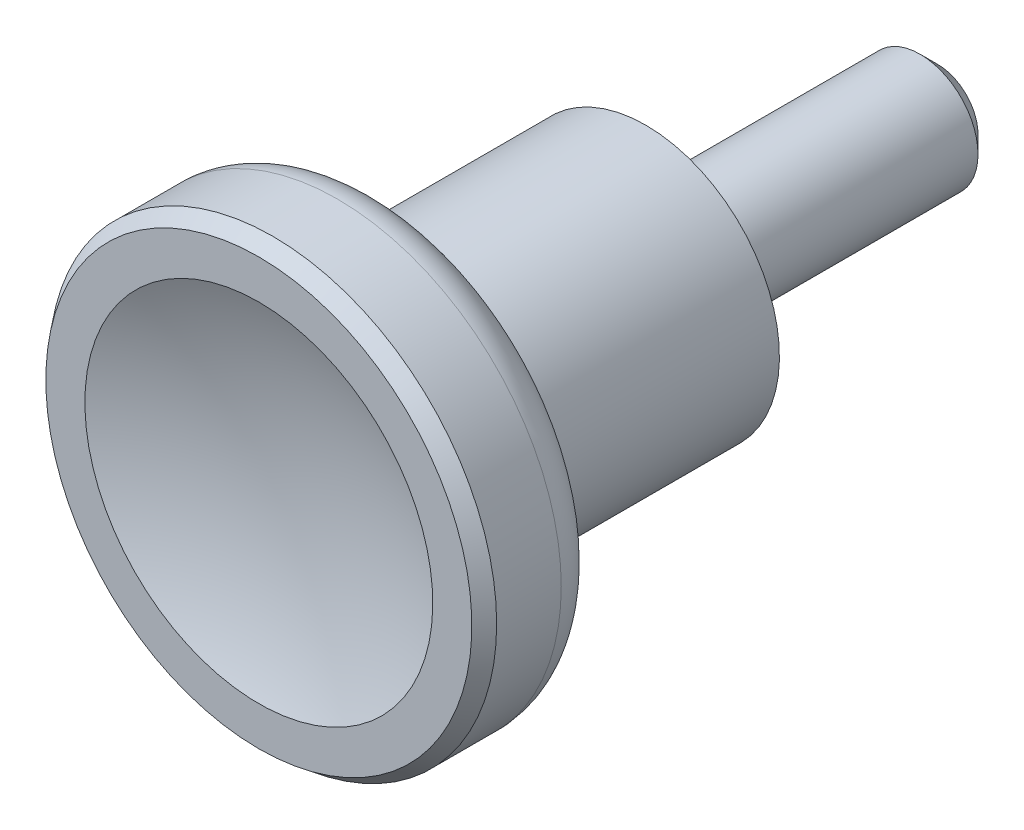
ISO-10303-21;
HEADER;
FILE_DESCRIPTION(('STEP AP214'),'2;1');
FILE_NAME('part.step','',(''),(''),'','','');
FILE_SCHEMA(('AUTOMOTIVE_DESIGN { 1 0 10303 214 1 1 1 1 }'));
ENDSEC;
DATA;
#1=APPLICATION_CONTEXT('core data for automotive mechanical design processes');
#2=APPLICATION_PROTOCOL_DEFINITION('international standard','automotive_design',2000,#1);
#3=PRODUCT_CONTEXT('',#1,'mechanical');
#4=PRODUCT('Part','Part','',(#3));
#5=PRODUCT_RELATED_PRODUCT_CATEGORY('part','',(#4));
#6=PRODUCT_DEFINITION_FORMATION('','',#4);
#7=PRODUCT_DEFINITION_CONTEXT('part definition',#1,'design');
#8=PRODUCT_DEFINITION('design','',#6,#7);
#9=PRODUCT_DEFINITION_SHAPE('','',#8);
#10=(LENGTH_UNIT() NAMED_UNIT(*) SI_UNIT(.MILLI.,.METRE.));
#11=(NAMED_UNIT(*) PLANE_ANGLE_UNIT() SI_UNIT($,.RADIAN.));
#12=(NAMED_UNIT(*) SI_UNIT($,.STERADIAN.) SOLID_ANGLE_UNIT());
#13=UNCERTAINTY_MEASURE_WITH_UNIT(LENGTH_MEASURE(1.E-05),#10,'distance_accuracy_value','');
#14=(GEOMETRIC_REPRESENTATION_CONTEXT(3) GLOBAL_UNCERTAINTY_ASSIGNED_CONTEXT((#13)) GLOBAL_UNIT_ASSIGNED_CONTEXT((#10,
#11,#12)) REPRESENTATION_CONTEXT('',''));
#15=CARTESIAN_POINT('',(0.,0.,0.));
#16=DIRECTION('',(0.,0.,1.));
#17=DIRECTION('',(1.,0.,0.));
#18=AXIS2_PLACEMENT_3D('',#15,#16,#17);
#19=CARTESIAN_POINT('',(9.25,0.,0.2));
#20=DIRECTION('',(0.,0.,1.));
#21=DIRECTION('',(0.,-1.,0.));
#22=AXIS2_PLACEMENT_3D('',#19,#20,#21);
#23=PLANE('',#22);
#24=CARTESIAN_POINT('',(0.,0.,0.2));
#25=DIRECTION('',(0.,0.,-1.));
#26=DIRECTION('',(0.,1.,0.));
#27=AXIS2_PLACEMENT_3D('',#24,#25,#26);
#28=CIRCLE('',#27,5.);
#29=CARTESIAN_POINT('',(0.,5.,0.2));
#30=VERTEX_POINT('',#29);
#31=EDGE_CURVE('E56',#30,#30,#28,.T.);
#32=ORIENTED_EDGE('',*,*,#31,.F.);
#33=EDGE_LOOP('',(#32));
#34=FACE_BOUND('',#33,.T.);
#35=CARTESIAN_POINT('',(0.,0.,0.2));
#36=DIRECTION('',(0.,0.,-1.));
#37=DIRECTION('',(0.,1.,0.));
#38=AXIS2_PLACEMENT_3D('',#35,#36,#37);
#39=CIRCLE('',#38,9.25);
#40=CARTESIAN_POINT('',(0.,9.25,0.2));
#41=VERTEX_POINT('',#40);
#42=EDGE_CURVE('E23',#41,#41,#39,.T.);
#43=ORIENTED_EDGE('',*,*,#42,.T.);
#44=EDGE_LOOP('',(#43));
#45=FACE_BOUND('',#44,.T.);
#46=ADVANCED_FACE('F12',(#34,#45),#23,.F.);
#47=CARTESIAN_POINT('',(0.,0.,-4.9324732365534));
#48=DIRECTION('',(0.,0.,-1.));
#49=DIRECTION('',(0.,1.,0.));
#50=AXIS2_PLACEMENT_3D('',#47,#48,#49);
#51=CYLINDRICAL_SURFACE('',#50,9.25);
#52=CARTESIAN_POINT('',(0.,0.,17.));
#53=DIRECTION('',(0.,0.,-1.));
#54=DIRECTION('',(0.,1.,0.));
#55=AXIS2_PLACEMENT_3D('',#52,#53,#54);
#56=CIRCLE('',#55,9.25);
#57=CARTESIAN_POINT('',(0.,9.25,17.));
#58=VERTEX_POINT('',#57);
#59=EDGE_CURVE('E27',#58,#58,#56,.T.);
#60=ORIENTED_EDGE('',*,*,#59,.T.);
#61=EDGE_LOOP('',(#60));
#62=FACE_BOUND('',#61,.T.);
#63=ORIENTED_EDGE('',*,*,#42,.F.);
#64=EDGE_LOOP('',(#63));
#65=FACE_BOUND('',#64,.T.);
#66=ADVANCED_FACE('F64',(#62,#65),#51,.T.);
#67=CARTESIAN_POINT('',(0.,0.,17.));
#68=DIRECTION('',(0.,0.,-1.));
#69=DIRECTION('',(0.,1.,0.));
#70=AXIS2_PLACEMENT_3D('',#67,#68,#69);
#71=TOROIDAL_SURFACE('',#70,10.0070026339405,0.757002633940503);
#72=ORIENTED_EDGE('',*,*,#59,.F.);
#73=EDGE_LOOP('',(#72));
#74=FACE_BOUND('',#73,.T.);
#75=CARTESIAN_POINT('',(0.,0.,17.7312080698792));
#76=DIRECTION('',(0.,0.,-1.));
#77=DIRECTION('',(0.,1.,0.));
#78=AXIS2_PLACEMENT_3D('',#75,#76,#77);
#79=CIRCLE('',#78,9.81107472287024);
#80=CARTESIAN_POINT('',(0.,9.81107472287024,17.7312080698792));
#81=VERTEX_POINT('',#80);
#82=EDGE_CURVE('E32',#81,#81,#79,.T.);
#83=ORIENTED_EDGE('',*,*,#82,.T.);
#84=EDGE_LOOP('',(#83));
#85=FACE_BOUND('',#84,.T.);
#86=ADVANCED_FACE('F68',(#74,#85),#71,.F.);
#87=CARTESIAN_POINT('',(0.,0.,17.7312080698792));
#88=DIRECTION('',(0.,0.,1.));
#89=DIRECTION('',(0.,-1.,0.));
#90=AXIS2_PLACEMENT_3D('',#87,#88,#89);
#91=CONICAL_SURFACE('',#90,9.81107472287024,1.30899528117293);
#92=CARTESIAN_POINT('',(0.,0.,18.6597619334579));
#93=DIRECTION('',(0.,0.,-1.));
#94=DIRECTION('',(0.,1.,0.));
#95=AXIS2_PLACEMENT_3D('',#92,#93,#94);
#96=CIRCLE('',#95,13.2764619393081);
#97=CARTESIAN_POINT('',(0.,13.2764619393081,18.6597619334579));
#98=VERTEX_POINT('',#97);
#99=EDGE_CURVE('E35',#98,#98,#96,.T.);
#100=ORIENTED_EDGE('',*,*,#99,.T.);
#101=EDGE_LOOP('',(#100));
#102=FACE_BOUND('',#101,.T.);
#103=ORIENTED_EDGE('',*,*,#82,.F.);
#104=EDGE_LOOP('',(#103));
#105=FACE_BOUND('',#104,.T.);
#106=ADVANCED_FACE('F76',(#102,#105),#91,.T.);
#107=CARTESIAN_POINT('',(0.,0.,21.5575381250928));
#108=DIRECTION('',(0.,0.,-1.));
#109=DIRECTION('',(0.,1.,0.));
#110=AXIS2_PLACEMENT_3D('',#107,#108,#109);
#111=TOROIDAL_SURFACE('',#110,12.5,3.);
#112=CARTESIAN_POINT('',(0.,0.,21.5575381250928));
#113=DIRECTION('',(0.,0.,-1.));
#114=DIRECTION('',(0.,1.,0.));
#115=AXIS2_PLACEMENT_3D('',#112,#113,#114);
#116=CIRCLE('',#115,15.5);
#117=CARTESIAN_POINT('',(0.,15.5,21.5575381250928));
#118=VERTEX_POINT('',#117);
#119=EDGE_CURVE('E38',#118,#118,#116,.T.);
#120=ORIENTED_EDGE('',*,*,#119,.T.);
#121=EDGE_LOOP('',(#120));
#122=FACE_BOUND('',#121,.T.);
#123=ORIENTED_EDGE('',*,*,#99,.F.);
#124=EDGE_LOOP('',(#123));
#125=FACE_BOUND('',#124,.T.);
#126=ADVANCED_FACE('F82',(#122,#125),#111,.T.);
#127=CARTESIAN_POINT('',(0.,0.,-4.9324732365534));
#128=DIRECTION('',(0.,0.,-1.));
#129=DIRECTION('',(0.,1.,0.));
#130=AXIS2_PLACEMENT_3D('',#127,#128,#129);
#131=CYLINDRICAL_SURFACE('',#130,15.5);
#132=CARTESIAN_POINT('',(0.,0.,26.0301314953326));
#133=DIRECTION('',(0.,0.,-1.));
#134=DIRECTION('',(0.,1.,0.));
#135=AXIS2_PLACEMENT_3D('',#132,#133,#134);
#136=CIRCLE('',#135,15.5);
#137=CARTESIAN_POINT('',(0.,15.5,26.0301314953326));
#138=VERTEX_POINT('',#137);
#139=EDGE_CURVE('E41',#138,#138,#136,.T.);
#140=ORIENTED_EDGE('',*,*,#139,.T.);
#141=EDGE_LOOP('',(#140));
#142=FACE_BOUND('',#141,.T.);
#143=ORIENTED_EDGE('',*,*,#119,.F.);
#144=EDGE_LOOP('',(#143));
#145=FACE_BOUND('',#144,.T.);
#146=ADVANCED_FACE('F86',(#142,#145),#131,.T.);
#147=CARTESIAN_POINT('',(0.,0.,27.));
#148=DIRECTION('',(0.,0.,-1.));
#149=DIRECTION('',(0.,1.,0.));
#150=AXIS2_PLACEMENT_3D('',#147,#148,#149);
#151=CONICAL_SURFACE('',#150,14.7507565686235,0.657759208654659);
#152=ORIENTED_EDGE('',*,*,#139,.F.);
#153=EDGE_LOOP('',(#152));
#154=FACE_BOUND('',#153,.T.);
#155=CARTESIAN_POINT('',(0.,0.,27.));
#156=DIRECTION('',(0.,0.,-1.));
#157=DIRECTION('',(0.,1.,0.));
#158=AXIS2_PLACEMENT_3D('',#155,#156,#157);
#159=CIRCLE('',#158,14.7507565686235);
#160=CARTESIAN_POINT('',(0.,14.7507565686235,27.));
#161=VERTEX_POINT('',#160);
#162=EDGE_CURVE('E44',#161,#161,#159,.T.);
#163=ORIENTED_EDGE('',*,*,#162,.T.);
#164=EDGE_LOOP('',(#163));
#165=FACE_BOUND('',#164,.T.);
#166=ADVANCED_FACE('F90',(#154,#165),#151,.T.);
#167=CARTESIAN_POINT('',(14.7507565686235,0.,27.));
#168=DIRECTION('',(0.,0.,1.));
#169=DIRECTION('',(0.,-1.,0.));
#170=AXIS2_PLACEMENT_3D('',#167,#168,#169);
#171=PLANE('',#170);
#172=CARTESIAN_POINT('',(0.,0.,27.));
#173=DIRECTION('',(0.,0.,-1.));
#174=DIRECTION('',(0.,1.,0.));
#175=AXIS2_PLACEMENT_3D('',#172,#173,#174);
#176=CIRCLE('',#175,12.0457822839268);
#177=CARTESIAN_POINT('',(0.,12.0457822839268,27.));
#178=VERTEX_POINT('',#177);
#179=EDGE_CURVE('E47',#178,#178,#176,.T.);
#180=ORIENTED_EDGE('',*,*,#179,.T.);
#181=EDGE_LOOP('',(#180));
#182=FACE_BOUND('',#181,.T.);
#183=ORIENTED_EDGE('',*,*,#162,.F.);
#184=EDGE_LOOP('',(#183));
#185=FACE_BOUND('',#184,.T.);
#186=ADVANCED_FACE('F94',(#182,#185),#171,.T.);
#187=CARTESIAN_POINT('',(0.,0.,54.5624551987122));
#188=DIRECTION('',(0.,-1.,0.));
#189=DIRECTION('',(1.,0.,0.));
#190=AXIS2_PLACEMENT_3D('',#187,#188,#189);
#191=SPHERICAL_SURFACE('',#190,30.0797241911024);
#192=CARTESIAN_POINT('',(0.,0.,54.5624551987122));
#193=DIRECTION('',(0.,0.,-1.));
#194=DIRECTION('',(0.,1.,0.));
#195=AXIS2_PLACEMENT_3D('',#192,#193,#194);
#196=SPHERICAL_SURFACE('',#195,30.0797241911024);
#197=ORIENTED_EDGE('',*,*,#179,.F.);
#198=EDGE_LOOP('',(#197));
#199=FACE_BOUND('',#198,.T.);
#200=ADVANCED_FACE('F98',(#199),#196,.F.);
#201=CARTESIAN_POINT('',(4.,0.,-20.));
#202=DIRECTION('',(0.,0.,1.));
#203=DIRECTION('',(0.,-1.,0.));
#204=AXIS2_PLACEMENT_3D('',#201,#202,#203);
#205=PLANE('',#204);
#206=CARTESIAN_POINT('',(0.,0.,-20.));
#207=DIRECTION('',(0.,0.,1.));
#208=DIRECTION('',(1.,0.,0.));
#209=AXIS2_PLACEMENT_3D('',#206,#207,#208);
#210=CIRCLE('',#209,2.8);
#211=CARTESIAN_POINT('',(2.8,0.,-20.));
#212=VERTEX_POINT('',#211);
#213=EDGE_CURVE('E19',#212,#212,#210,.F.);
#214=ORIENTED_EDGE('',*,*,#213,.T.);
#215=EDGE_LOOP('',(#214));
#216=FACE_BOUND('',#215,.T.);
#217=ADVANCED_FACE('F102',(#216),#205,.F.);
#218=CARTESIAN_POINT('',(0.,0.,-4.9324732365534));
#219=DIRECTION('',(0.,0.,-1.));
#220=DIRECTION('',(0.,1.,0.));
#221=AXIS2_PLACEMENT_3D('',#218,#219,#220);
#222=CYLINDRICAL_SURFACE('',#221,4.);
#223=CARTESIAN_POINT('',(0.,0.,-18.8));
#224=DIRECTION('',(0.,0.,1.));
#225=DIRECTION('',(1.,0.,0.));
#226=AXIS2_PLACEMENT_3D('',#223,#224,#225);
#227=CIRCLE('',#226,4.);
#228=CARTESIAN_POINT('',(4.,0.,-18.8));
#229=VERTEX_POINT('',#228);
#230=EDGE_CURVE('E8',#229,#229,#227,.T.);
#231=ORIENTED_EDGE('',*,*,#230,.T.);
#232=EDGE_LOOP('',(#231));
#233=FACE_BOUND('',#232,.T.);
#234=CARTESIAN_POINT('',(0.,0.,0.));
#235=DIRECTION('',(0.,0.,-1.));
#236=DIRECTION('',(0.,1.,0.));
#237=AXIS2_PLACEMENT_3D('',#234,#235,#236);
#238=CIRCLE('',#237,4.);
#239=CARTESIAN_POINT('',(0.,4.,0.));
#240=VERTEX_POINT('',#239);
#241=EDGE_CURVE('E50',#240,#240,#238,.T.);
#242=ORIENTED_EDGE('',*,*,#241,.T.);
#243=EDGE_LOOP('',(#242));
#244=FACE_BOUND('',#243,.T.);
#245=ADVANCED_FACE('F106',(#233,#244),#222,.T.);
#246=CARTESIAN_POINT('',(4.99999999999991,0.,0.));
#247=DIRECTION('',(0.,0.,1.));
#248=DIRECTION('',(0.,-1.,0.));
#249=AXIS2_PLACEMENT_3D('',#246,#247,#248);
#250=PLANE('',#249);
#251=ORIENTED_EDGE('',*,*,#241,.F.);
#252=EDGE_LOOP('',(#251));
#253=FACE_BOUND('',#252,.T.);
#254=CARTESIAN_POINT('',(0.,0.,0.));
#255=DIRECTION('',(0.,0.,-1.));
#256=DIRECTION('',(0.,1.,0.));
#257=AXIS2_PLACEMENT_3D('',#254,#255,#256);
#258=CIRCLE('',#257,5.);
#259=CARTESIAN_POINT('',(0.,5.,0.));
#260=VERTEX_POINT('',#259);
#261=EDGE_CURVE('E53',#260,#260,#258,.T.);
#262=ORIENTED_EDGE('',*,*,#261,.T.);
#263=EDGE_LOOP('',(#262));
#264=FACE_BOUND('',#263,.T.);
#265=ADVANCED_FACE('F109',(#253,#264),#250,.F.);
#266=CARTESIAN_POINT('',(0.,0.,-4.9324732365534));
#267=DIRECTION('',(0.,0.,-1.));
#268=DIRECTION('',(0.,1.,0.));
#269=AXIS2_PLACEMENT_3D('',#266,#267,#268);
#270=CYLINDRICAL_SURFACE('',#269,5.);
#271=ORIENTED_EDGE('',*,*,#261,.F.);
#272=EDGE_LOOP('',(#271));
#273=FACE_BOUND('',#272,.T.);
#274=ORIENTED_EDGE('',*,*,#31,.T.);
#275=EDGE_LOOP('',(#274));
#276=FACE_BOUND('',#275,.T.);
#277=ADVANCED_FACE('F60',(#273,#276),#270,.T.);
#278=CARTESIAN_POINT('',(0.,0.,-20.));
#279=DIRECTION('',(0.,0.,1.));
#280=DIRECTION('',(1.,0.,0.));
#281=AXIS2_PLACEMENT_3D('',#278,#279,#280);
#282=CONICAL_SURFACE('',#281,2.8,0.785398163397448);
#283=ORIENTED_EDGE('',*,*,#230,.F.);
#284=EDGE_LOOP('',(#283));
#285=FACE_BOUND('',#284,.T.);
#286=ORIENTED_EDGE('',*,*,#213,.F.);
#287=EDGE_LOOP('',(#286));
#288=FACE_BOUND('',#287,.T.);
#289=ADVANCED_FACE('F14',(#285,#288),#282,.T.);
#290=CLOSED_SHELL('',(#46,#66,#86,#106,#126,#146,#166,#186,#200,#217,#245,#265,#277,#289));
#291=MANIFOLD_SOLID_BREP('B1',#290);
#292=ADVANCED_BREP_SHAPE_REPRESENTATION('',(#18,#291),#14);
#293=SHAPE_DEFINITION_REPRESENTATION(#9,#292);
ENDSEC;
END-ISO-10303-21;
